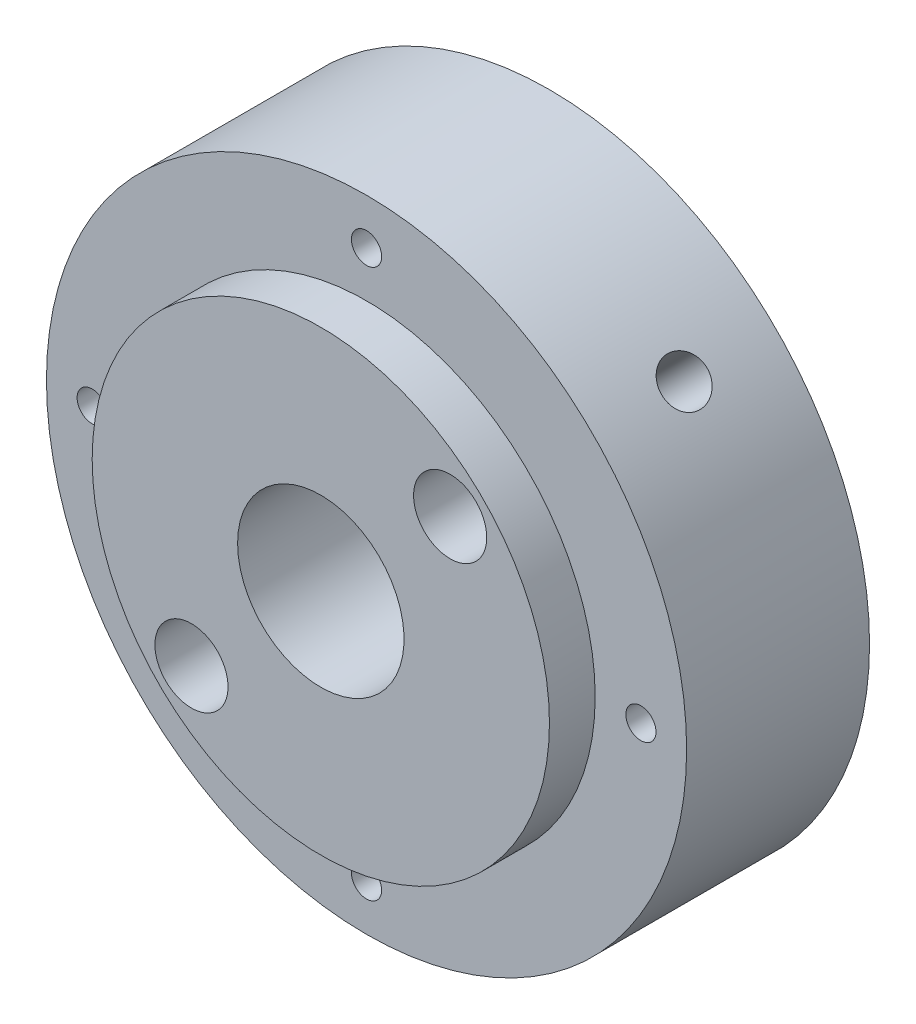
from build123d import *

# Parameters (mm, degrees)
SKETCH_2_R          = 35
SKETCH_2_R_2        = 9.1
SKETCH_2_R_3        = 4
EXTRUDE_1_DEPTH     = 20
SKETCH_3_R          = 25
EXTRUDE_2_DEPTH     = 5
SKETCH_4_R          = 9.1
SKETCH_4_R_2        = 4
CUT_EXTRUDE_1_DEPTH = 54.38539126
SKETCH_5_R          = 1.65
CUT_EXTRUDE_2_DEPTH = 17
SKETCH_6_R          = 2.5
CUT_EXTRUDE_3_DEPTH = 17
CUT_EXTRUDE_START   = -17
SKETCH_7_R          = 2.5
CUT_EXTRUDE_4_DEPTH = 17


with BuildPart() as part:
    # Sketch 2 → Extrude 1 (new body)
    with BuildSketch(Plane.XY):
        Circle(SKETCH_2_R)
        Circle(SKETCH_2_R_2, mode=Mode.SUBTRACT)
        with Locations((-14.142135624, -14.142135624)):
            Circle(SKETCH_2_R_3, mode=Mode.SUBTRACT)
        with Locations((14.142135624, 14.142135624)):
            Circle(SKETCH_2_R_3, mode=Mode.SUBTRACT)
    extrude(amount=EXTRUDE_1_DEPTH)

    # Sketch 3 → Extrude 2 (add)
    with BuildSketch(Plane.XY.offset(20)):
        Circle(SKETCH_3_R)
    extrude(amount=EXTRUDE_2_DEPTH)

    # Sketch 4 → Cut-Extrude 1 (cut, through all)
    with BuildSketch(Plane(origin=(0, 0, 20), x_dir=(-1, 0, 0), z_dir=(0, 0, -1))):
        Circle(SKETCH_4_R)
        with Locations((-14.142135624, 14.142135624)):
            Circle(SKETCH_4_R_2)
        with Locations((14.142135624, -14.142135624)):
            Circle(SKETCH_4_R_2)
    extrude(amount=-CUT_EXTRUDE_1_DEPTH, mode=Mode.SUBTRACT)

    # Sketch 5 → Cut-Extrude 2 (cut)
    with BuildSketch(Plane.XY.offset(25)):
        with Locations((0, 30)):
            Circle(SKETCH_5_R)
        with Locations((30, 0)):
            Circle(SKETCH_5_R)
        with Locations((0, -30)):
            Circle(SKETCH_5_R)
        with Locations((-30, 0)):
            Circle(SKETCH_5_R)
    extrude(amount=-CUT_EXTRUDE_2_DEPTH, mode=Mode.SUBTRACT)

    # Sketch 6 → Cut-Extrude 3 (cut)
    with BuildSketch(Plane(origin=(-24.748737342, -24.748737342, 0), x_dir=(0, 0, -1), z_dir=(-0.7071067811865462, -0.7071067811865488, 0))):
        with Locations(Location((-10, 0, 0), (0, 0, 90))):
            Circle(SKETCH_6_R)
    extrude(amount=-CUT_EXTRUDE_3_DEPTH, mode=Mode.SUBTRACT)

    # Sketch 7 → Cut-Extrude 4 (cut)
    with BuildSketch(Plane(origin=(24.748737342, 24.748737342, 0), x_dir=(0, 0, -1), z_dir=(0.7071067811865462, 0.7071067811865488, 0)).offset(CUT_EXTRUDE_START)):
        with Locations(Location((-10, 0, 0), (0, 0, 270))):
            Circle(SKETCH_7_R)
    extrude(amount=CUT_EXTRUDE_4_DEPTH, mode=Mode.SUBTRACT)


solid = part.part
